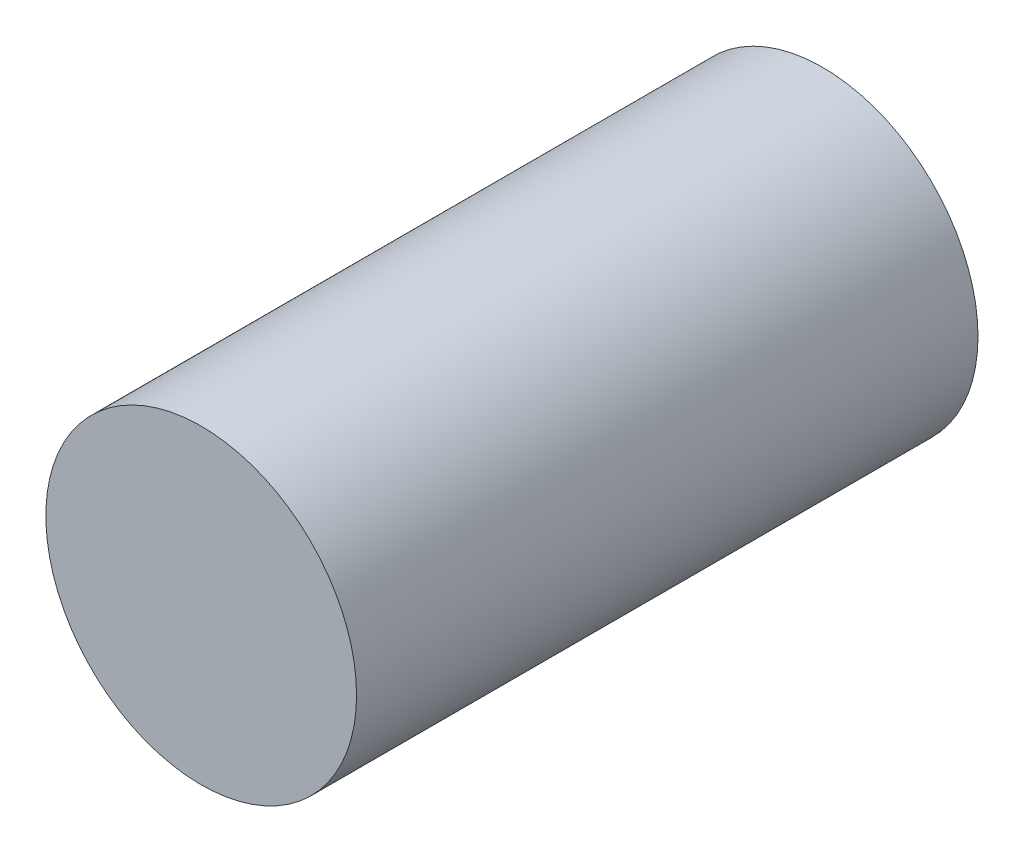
from build123d import *

# Parameters (mm, degrees)
SKETCH1_R           = 1.5
BOSS_EXTRUDE1_DEPTH = 6


with BuildPart() as part:
    # Sketch1 → Boss-Extrude1 (new body)
    with BuildSketch(Plane.XY):
        Circle(SKETCH1_R)
    extrude(amount=BOSS_EXTRUDE1_DEPTH)


solid = part.part
